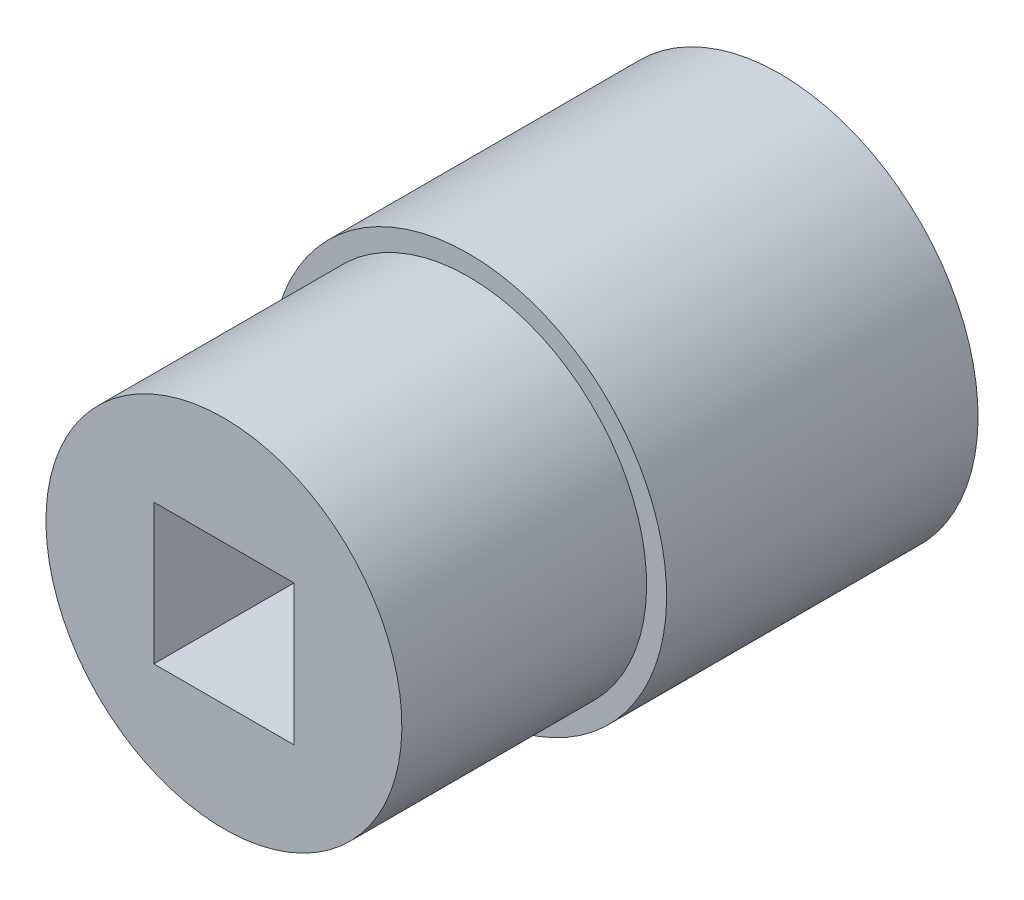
ISO-10303-21;
HEADER;
FILE_DESCRIPTION(('STEP AP214'),'2;1');
FILE_NAME('part.step','',(''),(''),'','','');
FILE_SCHEMA(('AUTOMOTIVE_DESIGN { 1 0 10303 214 1 1 1 1 }'));
ENDSEC;
DATA;
#1=APPLICATION_CONTEXT('core data for automotive mechanical design processes');
#2=APPLICATION_PROTOCOL_DEFINITION('international standard','automotive_design',2000,#1);
#3=PRODUCT_CONTEXT('',#1,'mechanical');
#4=PRODUCT('Part','Part','',(#3));
#5=PRODUCT_RELATED_PRODUCT_CATEGORY('part','',(#4));
#6=PRODUCT_DEFINITION_FORMATION('','',#4);
#7=PRODUCT_DEFINITION_CONTEXT('part definition',#1,'design');
#8=PRODUCT_DEFINITION('design','',#6,#7);
#9=PRODUCT_DEFINITION_SHAPE('','',#8);
#10=(LENGTH_UNIT() NAMED_UNIT(*) SI_UNIT(.MILLI.,.METRE.));
#11=(NAMED_UNIT(*) PLANE_ANGLE_UNIT() SI_UNIT($,.RADIAN.));
#12=(NAMED_UNIT(*) SI_UNIT($,.STERADIAN.) SOLID_ANGLE_UNIT());
#13=UNCERTAINTY_MEASURE_WITH_UNIT(LENGTH_MEASURE(1.E-05),#10,'distance_accuracy_value','');
#14=(GEOMETRIC_REPRESENTATION_CONTEXT(3) GLOBAL_UNCERTAINTY_ASSIGNED_CONTEXT((#13)) GLOBAL_UNIT_ASSIGNED_CONTEXT((#10,
#11,#12)) REPRESENTATION_CONTEXT('',''));
#15=CARTESIAN_POINT('',(0.,0.,0.));
#16=DIRECTION('',(0.,0.,1.));
#17=DIRECTION('',(1.,0.,0.));
#18=AXIS2_PLACEMENT_3D('',#15,#16,#17);
#19=CARTESIAN_POINT('',(0.,0.,0.));
#20=DIRECTION('',(0.,0.,-1.));
#21=DIRECTION('',(0.,1.,0.));
#22=AXIS2_PLACEMENT_3D('',#19,#20,#21);
#23=PLANE('',#22);
#24=DIRECTION('',(0.866025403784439,-0.5,0.));
#25=VECTOR('',#24,1.);
#26=CARTESIAN_POINT('',(0.,7.50555349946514,0.));
#27=LINE('',#26,#25);
#28=CARTESIAN_POINT('',(0.,7.50555349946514,0.));
#29=VERTEX_POINT('',#28);
#30=CARTESIAN_POINT('',(6.5,3.75277674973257,0.));
#31=VERTEX_POINT('',#30);
#32=EDGE_CURVE('E36',#29,#31,#27,.T.);
#33=ORIENTED_EDGE('',*,*,#32,.F.);
#34=DIRECTION('',(0.866025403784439,0.5,0.));
#35=VECTOR('',#34,1.);
#36=CARTESIAN_POINT('',(-6.5,3.75277674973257,0.));
#37=LINE('',#36,#35);
#38=CARTESIAN_POINT('',(-6.5,3.75277674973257,0.));
#39=VERTEX_POINT('',#38);
#40=EDGE_CURVE('E132',#39,#29,#37,.T.);
#41=ORIENTED_EDGE('',*,*,#40,.F.);
#42=DIRECTION('',(0.,1.,0.));
#43=VECTOR('',#42,1.);
#44=CARTESIAN_POINT('',(-6.5,-3.75277674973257,0.));
#45=LINE('',#44,#43);
#46=CARTESIAN_POINT('',(-6.5,-3.75277674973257,0.));
#47=VERTEX_POINT('',#46);
#48=EDGE_CURVE('E158',#47,#39,#45,.T.);
#49=ORIENTED_EDGE('',*,*,#48,.F.);
#50=DIRECTION('',(-0.866025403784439,0.5,0.));
#51=VECTOR('',#50,1.);
#52=CARTESIAN_POINT('',(0.,-7.50555349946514,0.));
#53=LINE('',#52,#51);
#54=CARTESIAN_POINT('',(0.,-7.50555349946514,0.));
#55=VERTEX_POINT('',#54);
#56=EDGE_CURVE('E155',#55,#47,#53,.T.);
#57=ORIENTED_EDGE('',*,*,#56,.F.);
#58=DIRECTION('',(-0.866025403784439,-0.5,0.));
#59=VECTOR('',#58,1.);
#60=CARTESIAN_POINT('',(6.5,-3.75277674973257,0.));
#61=LINE('',#60,#59);
#62=CARTESIAN_POINT('',(6.5,-3.75277674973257,0.));
#63=VERTEX_POINT('',#62);
#64=EDGE_CURVE('E152',#63,#55,#61,.T.);
#65=ORIENTED_EDGE('',*,*,#64,.F.);
#66=DIRECTION('',(0.,-1.,0.));
#67=VECTOR('',#66,1.);
#68=CARTESIAN_POINT('',(6.5,3.75277674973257,0.));
#69=LINE('',#68,#67);
#70=EDGE_CURVE('E149',#31,#63,#69,.T.);
#71=ORIENTED_EDGE('',*,*,#70,.F.);
#72=EDGE_LOOP('',(#33,#41,#49,#57,#65,#71));
#73=FACE_BOUND('',#72,.T.);
#74=CARTESIAN_POINT('',(0.,0.,0.));
#75=DIRECTION('',(0.,0.,-1.));
#76=DIRECTION('',(0.,1.,0.));
#77=AXIS2_PLACEMENT_3D('',#74,#75,#76);
#78=CIRCLE('',#77,8.9);
#79=CARTESIAN_POINT('',(0.,8.9,0.));
#80=VERTEX_POINT('',#79);
#81=EDGE_CURVE('E9',#80,#80,#78,.T.);
#82=ORIENTED_EDGE('',*,*,#81,.T.);
#83=EDGE_LOOP('',(#82));
#84=FACE_BOUND('',#83,.T.);
#85=ADVANCED_FACE('F14',(#73,#84),#23,.T.);
#86=CARTESIAN_POINT('',(0.,0.,0.));
#87=DIRECTION('',(0.,0.,-1.));
#88=DIRECTION('',(0.,1.,0.));
#89=AXIS2_PLACEMENT_3D('',#86,#87,#88);
#90=CYLINDRICAL_SURFACE('',#89,8.9);
#91=CARTESIAN_POINT('',(0.,0.,14.));
#92=DIRECTION('',(0.,0.,-1.));
#93=DIRECTION('',(0.,1.,0.));
#94=AXIS2_PLACEMENT_3D('',#91,#92,#93);
#95=CIRCLE('',#94,8.9);
#96=CARTESIAN_POINT('',(0.,8.9,14.));
#97=VERTEX_POINT('',#96);
#98=EDGE_CURVE('E21',#97,#97,#95,.T.);
#99=ORIENTED_EDGE('',*,*,#98,.T.);
#100=EDGE_LOOP('',(#99));
#101=FACE_BOUND('',#100,.T.);
#102=ORIENTED_EDGE('',*,*,#81,.F.);
#103=EDGE_LOOP('',(#102));
#104=FACE_BOUND('',#103,.T.);
#105=ADVANCED_FACE('F182',(#101,#104),#90,.T.);
#106=CARTESIAN_POINT('',(8.9,0.,14.));
#107=DIRECTION('',(0.,0.,1.));
#108=DIRECTION('',(0.,-1.,0.));
#109=AXIS2_PLACEMENT_3D('',#106,#107,#108);
#110=PLANE('',#109);
#111=CARTESIAN_POINT('',(0.,0.,14.));
#112=DIRECTION('',(0.,0.,-1.));
#113=DIRECTION('',(0.,1.,0.));
#114=AXIS2_PLACEMENT_3D('',#111,#112,#113);
#115=CIRCLE('',#114,8.);
#116=CARTESIAN_POINT('',(0.,8.,14.));
#117=VERTEX_POINT('',#116);
#118=EDGE_CURVE('E177',#117,#117,#115,.T.);
#119=ORIENTED_EDGE('',*,*,#118,.T.);
#120=EDGE_LOOP('',(#119));
#121=FACE_BOUND('',#120,.T.);
#122=ORIENTED_EDGE('',*,*,#98,.F.);
#123=EDGE_LOOP('',(#122));
#124=FACE_BOUND('',#123,.T.);
#125=ADVANCED_FACE('F185',(#121,#124),#110,.T.);
#126=CARTESIAN_POINT('',(0.,0.,0.));
#127=DIRECTION('',(0.,0.,-1.));
#128=DIRECTION('',(0.,1.,0.));
#129=AXIS2_PLACEMENT_3D('',#126,#127,#128);
#130=CYLINDRICAL_SURFACE('',#129,8.);
#131=CARTESIAN_POINT('',(0.,0.,25.));
#132=DIRECTION('',(0.,0.,-1.));
#133=DIRECTION('',(0.,1.,0.));
#134=AXIS2_PLACEMENT_3D('',#131,#132,#133);
#135=CIRCLE('',#134,8.);
#136=CARTESIAN_POINT('',(0.,8.,25.));
#137=VERTEX_POINT('',#136);
#138=EDGE_CURVE('E165',#137,#137,#135,.T.);
#139=ORIENTED_EDGE('',*,*,#138,.T.);
#140=EDGE_LOOP('',(#139));
#141=FACE_BOUND('',#140,.T.);
#142=ORIENTED_EDGE('',*,*,#118,.F.);
#143=EDGE_LOOP('',(#142));
#144=FACE_BOUND('',#143,.T.);
#145=ADVANCED_FACE('F187',(#141,#144),#130,.T.);
#146=CARTESIAN_POINT('',(8.,0.,25.));
#147=DIRECTION('',(0.,0.,1.));
#148=DIRECTION('',(0.,-1.,0.));
#149=AXIS2_PLACEMENT_3D('',#146,#147,#148);
#150=PLANE('',#149);
#151=DIRECTION('',(0.,1.,0.));
#152=VECTOR('',#151,1.);
#153=CARTESIAN_POINT('',(3.15,3.15,25.));
#154=LINE('',#153,#152);
#155=CARTESIAN_POINT('',(3.15,-3.15,25.));
#156=VERTEX_POINT('',#155);
#157=CARTESIAN_POINT('',(3.15,3.15,25.));
#158=VERTEX_POINT('',#157);
#159=EDGE_CURVE('E28',#156,#158,#154,.T.);
#160=ORIENTED_EDGE('',*,*,#159,.F.);
#161=DIRECTION('',(1.,0.,0.));
#162=VECTOR('',#161,1.);
#163=CARTESIAN_POINT('',(-3.15,-3.15,25.));
#164=LINE('',#163,#162);
#165=CARTESIAN_POINT('',(-3.15,-3.15,25.));
#166=VERTEX_POINT('',#165);
#167=EDGE_CURVE('E110',#166,#156,#164,.T.);
#168=ORIENTED_EDGE('',*,*,#167,.F.);
#169=DIRECTION('',(0.,-1.,0.));
#170=VECTOR('',#169,1.);
#171=CARTESIAN_POINT('',(-3.15,3.15,25.));
#172=LINE('',#171,#170);
#173=CARTESIAN_POINT('',(-3.15,3.15,25.));
#174=VERTEX_POINT('',#173);
#175=EDGE_CURVE('E113',#174,#166,#172,.T.);
#176=ORIENTED_EDGE('',*,*,#175,.F.);
#177=DIRECTION('',(-1.,0.,0.));
#178=VECTOR('',#177,1.);
#179=CARTESIAN_POINT('',(-3.15,3.15,25.));
#180=LINE('',#179,#178);
#181=EDGE_CURVE('E119',#158,#174,#180,.T.);
#182=ORIENTED_EDGE('',*,*,#181,.F.);
#183=EDGE_LOOP('',(#160,#168,#176,#182));
#184=FACE_BOUND('',#183,.T.);
#185=ORIENTED_EDGE('',*,*,#138,.F.);
#186=EDGE_LOOP('',(#185));
#187=FACE_BOUND('',#186,.T.);
#188=ADVANCED_FACE('F195',(#184,#187),#150,.T.);
#189=CARTESIAN_POINT('',(0.,7.50555349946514,10.));
#190=DIRECTION('',(0.5,0.866025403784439,0.));
#191=DIRECTION('',(-0.866025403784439,0.5,0.));
#192=AXIS2_PLACEMENT_3D('',#189,#190,#191);
#193=PLANE('',#192);
#194=ORIENTED_EDGE('',*,*,#32,.T.);
#195=DIRECTION('',(0.,0.,-1.));
#196=VECTOR('',#195,1.);
#197=CARTESIAN_POINT('',(6.5,3.75277674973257,10.));
#198=LINE('',#197,#196);
#199=CARTESIAN_POINT('',(6.5,3.75277674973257,10.));
#200=VERTEX_POINT('',#199);
#201=EDGE_CURVE('E147',#200,#31,#198,.T.);
#202=ORIENTED_EDGE('',*,*,#201,.F.);
#203=DIRECTION('',(0.866025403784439,-0.5,0.));
#204=VECTOR('',#203,1.);
#205=CARTESIAN_POINT('',(0.,7.50555349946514,10.));
#206=LINE('',#205,#204);
#207=CARTESIAN_POINT('',(0.,7.50555349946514,10.));
#208=VERTEX_POINT('',#207);
#209=EDGE_CURVE('E128',#208,#200,#206,.T.);
#210=ORIENTED_EDGE('',*,*,#209,.F.);
#211=DIRECTION('',(0.,0.,-1.));
#212=VECTOR('',#211,1.);
#213=CARTESIAN_POINT('',(0.,7.50555349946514,10.));
#214=LINE('',#213,#212);
#215=EDGE_CURVE('E163',#208,#29,#214,.T.);
#216=ORIENTED_EDGE('',*,*,#215,.T.);
#217=EDGE_LOOP('',(#194,#202,#210,#216));
#218=FACE_BOUND('',#217,.T.);
#219=ADVANCED_FACE('F214',(#218),#193,.F.);
#220=CARTESIAN_POINT('',(-6.5,3.75277674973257,10.));
#221=DIRECTION('',(-0.5,0.866025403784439,0.));
#222=DIRECTION('',(-0.866025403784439,-0.5,0.));
#223=AXIS2_PLACEMENT_3D('',#220,#221,#222);
#224=PLANE('',#223);
#225=ORIENTED_EDGE('',*,*,#40,.T.);
#226=ORIENTED_EDGE('',*,*,#215,.F.);
#227=DIRECTION('',(0.866025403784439,0.5,0.));
#228=VECTOR('',#227,1.);
#229=CARTESIAN_POINT('',(-6.5,3.75277674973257,10.));
#230=LINE('',#229,#228);
#231=CARTESIAN_POINT('',(-6.5,3.75277674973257,10.));
#232=VERTEX_POINT('',#231);
#233=EDGE_CURVE('E144',#232,#208,#230,.T.);
#234=ORIENTED_EDGE('',*,*,#233,.F.);
#235=DIRECTION('',(0.,0.,-1.));
#236=VECTOR('',#235,1.);
#237=CARTESIAN_POINT('',(-6.5,3.75277674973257,10.));
#238=LINE('',#237,#236);
#239=EDGE_CURVE('E166',#232,#39,#238,.T.);
#240=ORIENTED_EDGE('',*,*,#239,.T.);
#241=EDGE_LOOP('',(#225,#226,#234,#240));
#242=FACE_BOUND('',#241,.T.);
#243=ADVANCED_FACE('F220',(#242),#224,.F.);
#244=CARTESIAN_POINT('',(-6.5,-3.75277674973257,10.));
#245=DIRECTION('',(-1.,0.,0.));
#246=DIRECTION('',(0.,-1.,0.));
#247=AXIS2_PLACEMENT_3D('',#244,#245,#246);
#248=PLANE('',#247);
#249=ORIENTED_EDGE('',*,*,#48,.T.);
#250=ORIENTED_EDGE('',*,*,#239,.F.);
#251=DIRECTION('',(0.,1.,0.));
#252=VECTOR('',#251,1.);
#253=CARTESIAN_POINT('',(-6.5,-3.75277674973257,10.));
#254=LINE('',#253,#252);
#255=CARTESIAN_POINT('',(-6.5,-3.75277674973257,10.));
#256=VERTEX_POINT('',#255);
#257=EDGE_CURVE('E141',#256,#232,#254,.T.);
#258=ORIENTED_EDGE('',*,*,#257,.F.);
#259=DIRECTION('',(0.,0.,-1.));
#260=VECTOR('',#259,1.);
#261=CARTESIAN_POINT('',(-6.5,-3.75277674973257,10.));
#262=LINE('',#261,#260);
#263=EDGE_CURVE('E168',#256,#47,#262,.T.);
#264=ORIENTED_EDGE('',*,*,#263,.T.);
#265=EDGE_LOOP('',(#249,#250,#258,#264));
#266=FACE_BOUND('',#265,.T.);
#267=ADVANCED_FACE('F222',(#266),#248,.F.);
#268=CARTESIAN_POINT('',(0.,-7.50555349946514,10.));
#269=DIRECTION('',(-0.5,-0.866025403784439,0.));
#270=DIRECTION('',(0.866025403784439,-0.5,0.));
#271=AXIS2_PLACEMENT_3D('',#268,#269,#270);
#272=PLANE('',#271);
#273=ORIENTED_EDGE('',*,*,#56,.T.);
#274=ORIENTED_EDGE('',*,*,#263,.F.);
#275=DIRECTION('',(-0.866025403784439,0.5,0.));
#276=VECTOR('',#275,1.);
#277=CARTESIAN_POINT('',(0.,-7.50555349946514,10.));
#278=LINE('',#277,#276);
#279=CARTESIAN_POINT('',(0.,-7.50555349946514,10.));
#280=VERTEX_POINT('',#279);
#281=EDGE_CURVE('E138',#280,#256,#278,.T.);
#282=ORIENTED_EDGE('',*,*,#281,.F.);
#283=DIRECTION('',(0.,0.,-1.));
#284=VECTOR('',#283,1.);
#285=CARTESIAN_POINT('',(0.,-7.50555349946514,10.));
#286=LINE('',#285,#284);
#287=EDGE_CURVE('E170',#280,#55,#286,.T.);
#288=ORIENTED_EDGE('',*,*,#287,.T.);
#289=EDGE_LOOP('',(#273,#274,#282,#288));
#290=FACE_BOUND('',#289,.T.);
#291=ADVANCED_FACE('F224',(#290),#272,.F.);
#292=CARTESIAN_POINT('',(6.5,-3.75277674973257,10.));
#293=DIRECTION('',(0.5,-0.866025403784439,0.));
#294=DIRECTION('',(0.866025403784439,0.5,0.));
#295=AXIS2_PLACEMENT_3D('',#292,#293,#294);
#296=PLANE('',#295);
#297=ORIENTED_EDGE('',*,*,#64,.T.);
#298=ORIENTED_EDGE('',*,*,#287,.F.);
#299=DIRECTION('',(-0.866025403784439,-0.5,0.));
#300=VECTOR('',#299,1.);
#301=CARTESIAN_POINT('',(6.5,-3.75277674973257,10.));
#302=LINE('',#301,#300);
#303=CARTESIAN_POINT('',(6.5,-3.75277674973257,10.));
#304=VERTEX_POINT('',#303);
#305=EDGE_CURVE('E135',#304,#280,#302,.T.);
#306=ORIENTED_EDGE('',*,*,#305,.F.);
#307=DIRECTION('',(0.,0.,-1.));
#308=VECTOR('',#307,1.);
#309=CARTESIAN_POINT('',(6.5,-3.75277674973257,10.));
#310=LINE('',#309,#308);
#311=EDGE_CURVE('E172',#304,#63,#310,.T.);
#312=ORIENTED_EDGE('',*,*,#311,.T.);
#313=EDGE_LOOP('',(#297,#298,#306,#312));
#314=FACE_BOUND('',#313,.T.);
#315=ADVANCED_FACE('F227',(#314),#296,.F.);
#316=CARTESIAN_POINT('',(6.5,3.75277674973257,10.));
#317=DIRECTION('',(1.,0.,0.));
#318=DIRECTION('',(0.,1.,0.));
#319=AXIS2_PLACEMENT_3D('',#316,#317,#318);
#320=PLANE('',#319);
#321=ORIENTED_EDGE('',*,*,#70,.T.);
#322=ORIENTED_EDGE('',*,*,#311,.F.);
#323=DIRECTION('',(0.,-1.,0.));
#324=VECTOR('',#323,1.);
#325=CARTESIAN_POINT('',(6.5,3.75277674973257,10.));
#326=LINE('',#325,#324);
#327=EDGE_CURVE('E131',#200,#304,#326,.T.);
#328=ORIENTED_EDGE('',*,*,#327,.F.);
#329=ORIENTED_EDGE('',*,*,#201,.T.);
#330=EDGE_LOOP('',(#321,#322,#328,#329));
#331=FACE_BOUND('',#330,.T.);
#332=ADVANCED_FACE('F210',(#331),#320,.F.);
#333=CARTESIAN_POINT('',(6.5,3.75277674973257,10.));
#334=DIRECTION('',(0.,0.,-1.));
#335=DIRECTION('',(0.,1.,0.));
#336=AXIS2_PLACEMENT_3D('',#333,#334,#335);
#337=PLANE('',#336);
#338=ORIENTED_EDGE('',*,*,#209,.T.);
#339=ORIENTED_EDGE('',*,*,#327,.T.);
#340=ORIENTED_EDGE('',*,*,#305,.T.);
#341=ORIENTED_EDGE('',*,*,#281,.T.);
#342=ORIENTED_EDGE('',*,*,#257,.T.);
#343=ORIENTED_EDGE('',*,*,#233,.T.);
#344=EDGE_LOOP('',(#338,#339,#340,#341,#342,#343));
#345=FACE_BOUND('',#344,.T.);
#346=ADVANCED_FACE('F217',(#345),#337,.T.);
#347=CARTESIAN_POINT('',(3.15,3.15,15.));
#348=DIRECTION('',(1.,0.,0.));
#349=DIRECTION('',(0.,1.,0.));
#350=AXIS2_PLACEMENT_3D('',#347,#348,#349);
#351=PLANE('',#350);
#352=ORIENTED_EDGE('',*,*,#159,.T.);
#353=DIRECTION('',(0.,0.,1.));
#354=VECTOR('',#353,1.);
#355=CARTESIAN_POINT('',(3.15,3.15,15.));
#356=LINE('',#355,#354);
#357=CARTESIAN_POINT('',(3.15,3.15,15.));
#358=VERTEX_POINT('',#357);
#359=EDGE_CURVE('E88',#358,#158,#356,.T.);
#360=ORIENTED_EDGE('',*,*,#359,.F.);
#361=DIRECTION('',(0.,1.,0.));
#362=VECTOR('',#361,1.);
#363=CARTESIAN_POINT('',(3.15,3.15,15.));
#364=LINE('',#363,#362);
#365=CARTESIAN_POINT('',(3.15,-3.15,15.));
#366=VERTEX_POINT('',#365);
#367=EDGE_CURVE('E92',#366,#358,#364,.T.);
#368=ORIENTED_EDGE('',*,*,#367,.F.);
#369=DIRECTION('',(0.,0.,1.));
#370=VECTOR('',#369,1.);
#371=CARTESIAN_POINT('',(3.15,-3.15,15.));
#372=LINE('',#371,#370);
#373=EDGE_CURVE('E123',#366,#156,#372,.T.);
#374=ORIENTED_EDGE('',*,*,#373,.T.);
#375=EDGE_LOOP('',(#352,#360,#368,#374));
#376=FACE_BOUND('',#375,.T.);
#377=ADVANCED_FACE('F90',(#376),#351,.F.);
#378=CARTESIAN_POINT('',(-3.15,-3.15,15.));
#379=DIRECTION('',(0.,-1.,0.));
#380=DIRECTION('',(1.,0.,0.));
#381=AXIS2_PLACEMENT_3D('',#378,#379,#380);
#382=PLANE('',#381);
#383=ORIENTED_EDGE('',*,*,#167,.T.);
#384=ORIENTED_EDGE('',*,*,#373,.F.);
#385=DIRECTION('',(1.,0.,0.));
#386=VECTOR('',#385,1.);
#387=CARTESIAN_POINT('',(-3.15,-3.15,15.));
#388=LINE('',#387,#386);
#389=CARTESIAN_POINT('',(-3.15,-3.15,15.));
#390=VERTEX_POINT('',#389);
#391=EDGE_CURVE('E98',#390,#366,#388,.T.);
#392=ORIENTED_EDGE('',*,*,#391,.F.);
#393=DIRECTION('',(0.,0.,1.));
#394=VECTOR('',#393,1.);
#395=CARTESIAN_POINT('',(-3.15,-3.15,15.));
#396=LINE('',#395,#394);
#397=EDGE_CURVE('E125',#390,#166,#396,.T.);
#398=ORIENTED_EDGE('',*,*,#397,.T.);
#399=EDGE_LOOP('',(#383,#384,#392,#398));
#400=FACE_BOUND('',#399,.T.);
#401=ADVANCED_FACE('F253',(#400),#382,.F.);
#402=CARTESIAN_POINT('',(-3.15,3.15,15.));
#403=DIRECTION('',(-1.,0.,0.));
#404=DIRECTION('',(0.,-1.,0.));
#405=AXIS2_PLACEMENT_3D('',#402,#403,#404);
#406=PLANE('',#405);
#407=ORIENTED_EDGE('',*,*,#175,.T.);
#408=ORIENTED_EDGE('',*,*,#397,.F.);
#409=DIRECTION('',(0.,-1.,0.));
#410=VECTOR('',#409,1.);
#411=CARTESIAN_POINT('',(-3.15,3.15,15.));
#412=LINE('',#411,#410);
#413=CARTESIAN_POINT('',(-3.15,3.15,15.));
#414=VERTEX_POINT('',#413);
#415=EDGE_CURVE('E106',#414,#390,#412,.T.);
#416=ORIENTED_EDGE('',*,*,#415,.F.);
#417=DIRECTION('',(0.,0.,1.));
#418=VECTOR('',#417,1.);
#419=CARTESIAN_POINT('',(-3.15,3.15,15.));
#420=LINE('',#419,#418);
#421=EDGE_CURVE('E97',#414,#174,#420,.T.);
#422=ORIENTED_EDGE('',*,*,#421,.T.);
#423=EDGE_LOOP('',(#407,#408,#416,#422));
#424=FACE_BOUND('',#423,.T.);
#425=ADVANCED_FACE('F251',(#424),#406,.F.);
#426=CARTESIAN_POINT('',(-3.15,3.15,15.));
#427=DIRECTION('',(0.,1.,0.));
#428=DIRECTION('',(-1.,0.,0.));
#429=AXIS2_PLACEMENT_3D('',#426,#427,#428);
#430=PLANE('',#429);
#431=ORIENTED_EDGE('',*,*,#181,.T.);
#432=ORIENTED_EDGE('',*,*,#421,.F.);
#433=DIRECTION('',(-1.,0.,0.));
#434=VECTOR('',#433,1.);
#435=CARTESIAN_POINT('',(-3.15,3.15,15.));
#436=LINE('',#435,#434);
#437=EDGE_CURVE('E101',#358,#414,#436,.T.);
#438=ORIENTED_EDGE('',*,*,#437,.F.);
#439=ORIENTED_EDGE('',*,*,#359,.T.);
#440=EDGE_LOOP('',(#431,#432,#438,#439));
#441=FACE_BOUND('',#440,.T.);
#442=ADVANCED_FACE('F102',(#441),#430,.F.);
#443=CARTESIAN_POINT('',(3.15,-3.15,15.));
#444=DIRECTION('',(0.,0.,1.));
#445=DIRECTION('',(0.,-1.,0.));
#446=AXIS2_PLACEMENT_3D('',#443,#444,#445);
#447=PLANE('',#446);
#448=ORIENTED_EDGE('',*,*,#367,.T.);
#449=ORIENTED_EDGE('',*,*,#437,.T.);
#450=ORIENTED_EDGE('',*,*,#415,.T.);
#451=ORIENTED_EDGE('',*,*,#391,.T.);
#452=EDGE_LOOP('',(#448,#449,#450,#451));
#453=FACE_BOUND('',#452,.T.);
#454=ADVANCED_FACE('F108',(#453),#447,.T.);
#455=CLOSED_SHELL('',(#85,#105,#125,#145,#188,#219,#243,#267,#291,#315,#332,#346,#377,#401,#425,
#442,#454));
#456=MANIFOLD_SOLID_BREP('B1',#455);
#457=ADVANCED_BREP_SHAPE_REPRESENTATION('',(#18,#456),#14);
#458=SHAPE_DEFINITION_REPRESENTATION(#9,#457);
ENDSEC;
END-ISO-10303-21;
